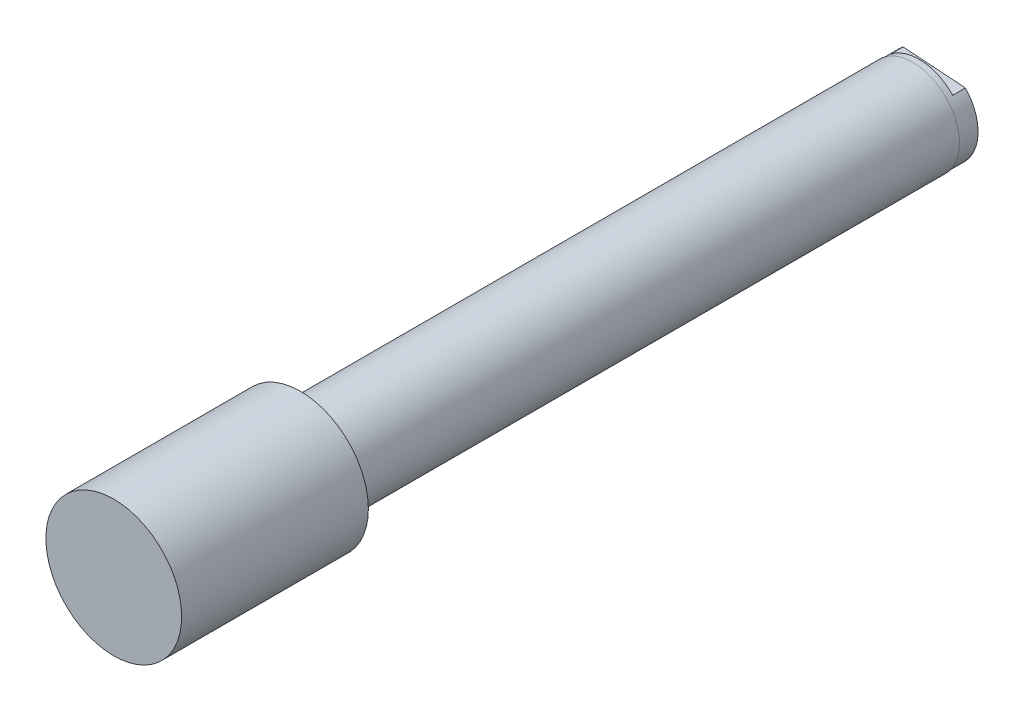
ISO-10303-21;
HEADER;
FILE_DESCRIPTION(('STEP AP214'),'2;1');
FILE_NAME('part.step','',(''),(''),'','','');
FILE_SCHEMA(('AUTOMOTIVE_DESIGN { 1 0 10303 214 1 1 1 1 }'));
ENDSEC;
DATA;
#1=APPLICATION_CONTEXT('core data for automotive mechanical design processes');
#2=APPLICATION_PROTOCOL_DEFINITION('international standard','automotive_design',2000,#1);
#3=PRODUCT_CONTEXT('',#1,'mechanical');
#4=PRODUCT('Part','Part','',(#3));
#5=PRODUCT_RELATED_PRODUCT_CATEGORY('part','',(#4));
#6=PRODUCT_DEFINITION_FORMATION('','',#4);
#7=PRODUCT_DEFINITION_CONTEXT('part definition',#1,'design');
#8=PRODUCT_DEFINITION('design','',#6,#7);
#9=PRODUCT_DEFINITION_SHAPE('','',#8);
#10=(LENGTH_UNIT() NAMED_UNIT(*) SI_UNIT(.MILLI.,.METRE.));
#11=(NAMED_UNIT(*) PLANE_ANGLE_UNIT() SI_UNIT($,.RADIAN.));
#12=(NAMED_UNIT(*) SI_UNIT($,.STERADIAN.) SOLID_ANGLE_UNIT());
#13=UNCERTAINTY_MEASURE_WITH_UNIT(LENGTH_MEASURE(1.E-05),#10,'distance_accuracy_value','');
#14=(GEOMETRIC_REPRESENTATION_CONTEXT(3) GLOBAL_UNCERTAINTY_ASSIGNED_CONTEXT((#13)) GLOBAL_UNIT_ASSIGNED_CONTEXT((#10,
#11,#12)) REPRESENTATION_CONTEXT('',''));
#15=CARTESIAN_POINT('',(0.,0.,0.));
#16=DIRECTION('',(0.,0.,1.));
#17=DIRECTION('',(1.,0.,0.));
#18=AXIS2_PLACEMENT_3D('',#15,#16,#17);
#19=CARTESIAN_POINT('',(0.,0.,-99.06));
#20=DIRECTION('',(0.,0.,1.));
#21=DIRECTION('',(0.997564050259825,-0.0697564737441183,0.));
#22=AXIS2_PLACEMENT_3D('',#19,#20,#21);
#23=PLANE('',#22);
#24=CARTESIAN_POINT('',(0.,0.,-99.06));
#25=DIRECTION('',(0.,0.,1.));
#26=DIRECTION('',(0.997564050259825,-0.0697564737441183,0.));
#27=AXIS2_PLACEMENT_3D('',#24,#25,#26);
#28=CIRCLE('',#27,3.4544);
#29=CARTESIAN_POINT('',(3.44598525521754,-0.240966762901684,-99.06));
#30=VERTEX_POINT('',#29);
#31=EDGE_CURVE('E11',#30,#30,#28,.F.);
#32=ORIENTED_EDGE('',*,*,#31,.T.);
#33=EDGE_LOOP('',(#32));
#34=FACE_BOUND('',#33,.T.);
#35=ADVANCED_FACE('F18',(#34),#23,.F.);
#36=CARTESIAN_POINT('',(0.,0.,-118.11));
#37=DIRECTION('',(0.,0.,-1.));
#38=DIRECTION('',(-0.997564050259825,0.0697564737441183,0.));
#39=AXIS2_PLACEMENT_3D('',#36,#37,#38);
#40=CYLINDRICAL_SURFACE('',#39,3.4544);
#41=CARTESIAN_POINT('',(0.,0.,-118.11));
#42=DIRECTION('',(0.,0.,-1.));
#43=DIRECTION('',(-0.997564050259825,0.0697564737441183,0.));
#44=AXIS2_PLACEMENT_3D('',#41,#42,#43);
#45=CIRCLE('',#44,3.4544);
#46=CARTESIAN_POINT('',(-3.44598525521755,0.24096676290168,-118.11));
#47=VERTEX_POINT('',#46);
#48=EDGE_CURVE('E90',#47,#47,#45,.T.);
#49=ORIENTED_EDGE('',*,*,#48,.T.);
#50=EDGE_LOOP('',(#49));
#51=FACE_BOUND('',#50,.T.);
#52=ORIENTED_EDGE('',*,*,#31,.F.);
#53=EDGE_LOOP('',(#52));
#54=FACE_BOUND('',#53,.T.);
#55=ADVANCED_FACE('F130',(#51,#54),#40,.F.);
#56=CARTESIAN_POINT('',(0.,0.,-118.11));
#57=DIRECTION('',(0.,0.,1.));
#58=DIRECTION('',(0.997564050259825,-0.0697564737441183,0.));
#59=AXIS2_PLACEMENT_3D('',#56,#57,#58);
#60=PLANE('',#59);
#61=ORIENTED_EDGE('',*,*,#48,.F.);
#62=EDGE_LOOP('',(#61));
#63=FACE_BOUND('',#62,.T.);
#64=CARTESIAN_POINT('',(0.,0.,-118.11));
#65=DIRECTION('',(0.,0.,-1.));
#66=DIRECTION('',(-0.997564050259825,0.0697564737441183,0.));
#67=AXIS2_PLACEMENT_3D('',#64,#65,#66);
#68=CIRCLE('',#67,8.636);
#69=CARTESIAN_POINT('',(-6.28172897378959,-5.9262447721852,-118.11));
#70=VERTEX_POINT('',#69);
#71=CARTESIAN_POINT('',(-5.39582175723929,6.74281866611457,-118.11));
#72=VERTEX_POINT('',#71);
#73=EDGE_CURVE('E27',#70,#72,#68,.T.);
#74=ORIENTED_EDGE('',*,*,#73,.T.);
#75=DIRECTION('',(-0.997564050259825,0.0697564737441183,0.));
#76=VECTOR('',#75,1.);
#77=CARTESIAN_POINT('',(6.28172897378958,5.9262447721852,-118.11));
#78=LINE('',#77,#76);
#79=CARTESIAN_POINT('',(6.28172897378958,5.9262447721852,-118.11));
#80=VERTEX_POINT('',#79);
#81=EDGE_CURVE('E64',#80,#72,#78,.T.);
#82=ORIENTED_EDGE('',*,*,#81,.F.);
#83=CARTESIAN_POINT('',(5.39582175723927,-6.74281866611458,-118.11));
#84=VERTEX_POINT('',#83);
#85=EDGE_CURVE('E76',#80,#84,#68,.T.);
#86=ORIENTED_EDGE('',*,*,#85,.T.);
#87=DIRECTION('',(0.997564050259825,-0.0697564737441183,0.));
#88=VECTOR('',#87,1.);
#89=CARTESIAN_POINT('',(5.39582175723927,-6.74281866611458,-118.11));
#90=LINE('',#89,#88);
#91=EDGE_CURVE('E78',#70,#84,#90,.T.);
#92=ORIENTED_EDGE('',*,*,#91,.F.);
#93=EDGE_LOOP('',(#74,#82,#86,#92));
#94=FACE_BOUND('',#93,.T.);
#95=ADVANCED_FACE('F115',(#63,#94),#60,.F.);
#96=CARTESIAN_POINT('',(0.,0.,-119.104542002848));
#97=DIRECTION('',(0.,0.,-1.));
#98=DIRECTION('',(-0.997564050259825,0.0697564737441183,0.));
#99=AXIS2_PLACEMENT_3D('',#96,#97,#98);
#100=CYLINDRICAL_SURFACE('',#99,8.636);
#101=CARTESIAN_POINT('',(0.,0.,-115.7224));
#102=DIRECTION('',(0.,0.,-1.));
#103=DIRECTION('',(-0.997564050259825,0.0697564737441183,0.));
#104=AXIS2_PLACEMENT_3D('',#101,#102,#103);
#105=CIRCLE('',#104,8.636);
#106=CARTESIAN_POINT('',(-5.39582175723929,6.74281866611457,-115.7224));
#107=VERTEX_POINT('',#106);
#108=CARTESIAN_POINT('',(6.28172897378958,5.9262447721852,-115.7224));
#109=VERTEX_POINT('',#108);
#110=EDGE_CURVE('E59',#107,#109,#105,.T.);
#111=ORIENTED_EDGE('',*,*,#110,.F.);
#112=DIRECTION('',(0.,0.,-1.));
#113=VECTOR('',#112,1.);
#114=CARTESIAN_POINT('',(-5.39582175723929,6.74281866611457,-115.7224));
#115=LINE('',#114,#113);
#116=EDGE_CURVE('E70',#107,#72,#115,.T.);
#117=ORIENTED_EDGE('',*,*,#116,.T.);
#118=ORIENTED_EDGE('',*,*,#73,.F.);
#119=DIRECTION('',(0.,0.,-1.));
#120=VECTOR('',#119,1.);
#121=CARTESIAN_POINT('',(-6.28172897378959,-5.9262447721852,-115.7224));
#122=LINE('',#121,#120);
#123=CARTESIAN_POINT('',(-6.28172897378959,-5.9262447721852,-115.7224));
#124=VERTEX_POINT('',#123);
#125=EDGE_CURVE('E85',#124,#70,#122,.T.);
#126=ORIENTED_EDGE('',*,*,#125,.F.);
#127=CARTESIAN_POINT('',(0.,0.,-115.7224));
#128=DIRECTION('',(0.,0.,-1.));
#129=DIRECTION('',(-0.997564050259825,0.0697564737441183,0.));
#130=AXIS2_PLACEMENT_3D('',#127,#128,#129);
#131=CIRCLE('',#130,8.636);
#132=CARTESIAN_POINT('',(5.39582175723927,-6.74281866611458,-115.7224));
#133=VERTEX_POINT('',#132);
#134=EDGE_CURVE('E82',#133,#124,#131,.T.);
#135=ORIENTED_EDGE('',*,*,#134,.F.);
#136=DIRECTION('',(0.,0.,-1.));
#137=VECTOR('',#136,1.);
#138=CARTESIAN_POINT('',(5.39582175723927,-6.74281866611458,-115.7224));
#139=LINE('',#138,#137);
#140=EDGE_CURVE('E88',#133,#84,#139,.T.);
#141=ORIENTED_EDGE('',*,*,#140,.T.);
#142=ORIENTED_EDGE('',*,*,#85,.F.);
#143=DIRECTION('',(0.,0.,-1.));
#144=VECTOR('',#143,1.);
#145=CARTESIAN_POINT('',(6.28172897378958,5.9262447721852,-115.7224));
#146=LINE('',#145,#144);
#147=EDGE_CURVE('E68',#109,#80,#146,.T.);
#148=ORIENTED_EDGE('',*,*,#147,.F.);
#149=EDGE_LOOP('',(#111,#117,#118,#126,#135,#141,#142,#148));
#150=FACE_BOUND('',#149,.T.);
#151=CARTESIAN_POINT('',(0.,0.,-114.5286));
#152=DIRECTION('',(0.,0.,-1.));
#153=DIRECTION('',(-0.997564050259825,0.0697564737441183,0.));
#154=AXIS2_PLACEMENT_3D('',#151,#152,#153);
#155=CIRCLE('',#154,8.636);
#156=CARTESIAN_POINT('',(-8.61496313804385,0.602416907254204,-114.5286));
#157=VERTEX_POINT('',#156);
#158=EDGE_CURVE('E94',#157,#157,#155,.T.);
#159=ORIENTED_EDGE('',*,*,#158,.T.);
#160=EDGE_LOOP('',(#159));
#161=FACE_BOUND('',#160,.T.);
#162=ADVANCED_FACE('F73',(#150,#161),#100,.T.);
#163=CARTESIAN_POINT('',(5.39582175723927,-6.74281866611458,-115.7224));
#164=DIRECTION('',(0.0697564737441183,0.997564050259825,0.));
#165=DIRECTION('',(-0.997564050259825,0.0697564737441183,0.));
#166=AXIS2_PLACEMENT_3D('',#163,#164,#165);
#167=PLANE('',#166);
#168=ORIENTED_EDGE('',*,*,#91,.T.);
#169=ORIENTED_EDGE('',*,*,#140,.F.);
#170=DIRECTION('',(0.997564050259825,-0.0697564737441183,0.));
#171=VECTOR('',#170,1.);
#172=CARTESIAN_POINT('',(5.39582175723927,-6.74281866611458,-115.7224));
#173=LINE('',#172,#171);
#174=EDGE_CURVE('E41',#124,#133,#173,.T.);
#175=ORIENTED_EDGE('',*,*,#174,.F.);
#176=ORIENTED_EDGE('',*,*,#125,.T.);
#177=EDGE_LOOP('',(#168,#169,#175,#176));
#178=FACE_BOUND('',#177,.T.);
#179=ADVANCED_FACE('F117',(#178),#167,.F.);
#180=CARTESIAN_POINT('',(0.,0.,-115.7224));
#181=DIRECTION('',(0.,0.,-1.));
#182=DIRECTION('',(-0.997564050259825,0.0697564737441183,0.));
#183=AXIS2_PLACEMENT_3D('',#180,#181,#182);
#184=PLANE('',#183);
#185=ORIENTED_EDGE('',*,*,#134,.T.);
#186=ORIENTED_EDGE('',*,*,#174,.T.);
#187=EDGE_LOOP('',(#185,#186));
#188=FACE_BOUND('',#187,.T.);
#189=ADVANCED_FACE('F119',(#188),#184,.T.);
#190=CARTESIAN_POINT('',(6.28172897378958,5.9262447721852,-115.7224));
#191=DIRECTION('',(-0.0697564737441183,-0.997564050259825,0.));
#192=DIRECTION('',(0.997564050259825,-0.0697564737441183,0.));
#193=AXIS2_PLACEMENT_3D('',#190,#191,#192);
#194=PLANE('',#193);
#195=ORIENTED_EDGE('',*,*,#81,.T.);
#196=ORIENTED_EDGE('',*,*,#116,.F.);
#197=DIRECTION('',(-0.997564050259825,0.0697564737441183,0.));
#198=VECTOR('',#197,1.);
#199=CARTESIAN_POINT('',(6.28172897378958,5.9262447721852,-115.7224));
#200=LINE('',#199,#198);
#201=EDGE_CURVE('E34',#109,#107,#200,.T.);
#202=ORIENTED_EDGE('',*,*,#201,.F.);
#203=ORIENTED_EDGE('',*,*,#147,.T.);
#204=EDGE_LOOP('',(#195,#196,#202,#203));
#205=FACE_BOUND('',#204,.T.);
#206=ADVANCED_FACE('F67',(#205),#194,.F.);
#207=CARTESIAN_POINT('',(0.,0.,-115.7224));
#208=DIRECTION('',(0.,0.,-1.));
#209=DIRECTION('',(-0.997564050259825,0.0697564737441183,0.));
#210=AXIS2_PLACEMENT_3D('',#207,#208,#209);
#211=PLANE('',#210);
#212=ORIENTED_EDGE('',*,*,#110,.T.);
#213=ORIENTED_EDGE('',*,*,#201,.T.);
#214=EDGE_LOOP('',(#212,#213));
#215=FACE_BOUND('',#214,.T.);
#216=ADVANCED_FACE('F60',(#215),#211,.T.);
#217=CARTESIAN_POINT('',(0.,0.,34.925));
#218=DIRECTION('',(0.,0.,1.));
#219=DIRECTION('',(1.,0.,0.));
#220=AXIS2_PLACEMENT_3D('',#217,#218,#219);
#221=PLANE('',#220);
#222=CARTESIAN_POINT('',(0.,0.,34.925));
#223=DIRECTION('',(0.,0.,1.));
#224=DIRECTION('',(1.,0.,0.));
#225=AXIS2_PLACEMENT_3D('',#222,#223,#224);
#226=CIRCLE('',#225,12.7);
#227=CARTESIAN_POINT('',(12.7,0.,34.925));
#228=VERTEX_POINT('',#227);
#229=EDGE_CURVE('E99',#228,#228,#226,.T.);
#230=ORIENTED_EDGE('',*,*,#229,.T.);
#231=EDGE_LOOP('',(#230));
#232=FACE_BOUND('',#231,.T.);
#233=ADVANCED_FACE('F148',(#232),#221,.T.);
#234=CARTESIAN_POINT('',(0.,0.,34.925));
#235=DIRECTION('',(0.,0.,-1.));
#236=DIRECTION('',(-1.,0.,0.));
#237=AXIS2_PLACEMENT_3D('',#234,#235,#236);
#238=CYLINDRICAL_SURFACE('',#237,12.7);
#239=ORIENTED_EDGE('',*,*,#229,.F.);
#240=EDGE_LOOP('',(#239));
#241=FACE_BOUND('',#240,.T.);
#242=CARTESIAN_POINT('',(0.,0.,0.));
#243=DIRECTION('',(0.,0.,1.));
#244=DIRECTION('',(1.,0.,0.));
#245=AXIS2_PLACEMENT_3D('',#242,#243,#244);
#246=CIRCLE('',#245,12.7);
#247=CARTESIAN_POINT('',(12.7,0.,0.));
#248=VERTEX_POINT('',#247);
#249=EDGE_CURVE('E103',#248,#248,#246,.T.);
#250=ORIENTED_EDGE('',*,*,#249,.T.);
#251=EDGE_LOOP('',(#250));
#252=FACE_BOUND('',#251,.T.);
#253=ADVANCED_FACE('F151',(#241,#252),#238,.T.);
#254=CARTESIAN_POINT('',(0.,0.,0.));
#255=DIRECTION('',(0.,0.,1.));
#256=DIRECTION('',(1.,0.,0.));
#257=AXIS2_PLACEMENT_3D('',#254,#255,#256);
#258=PLANE('',#257);
#259=CARTESIAN_POINT('',(0.,0.,0.));
#260=DIRECTION('',(0.,0.,1.));
#261=DIRECTION('',(1.,0.,0.));
#262=AXIS2_PLACEMENT_3D('',#259,#260,#261);
#263=CIRCLE('',#262,8.7376);
#264=CARTESIAN_POINT('',(8.7376,0.,0.));
#265=VERTEX_POINT('',#264);
#266=EDGE_CURVE('E102',#265,#265,#263,.F.);
#267=ORIENTED_EDGE('',*,*,#266,.F.);
#268=EDGE_LOOP('',(#267));
#269=FACE_BOUND('',#268,.T.);
#270=ORIENTED_EDGE('',*,*,#249,.F.);
#271=EDGE_LOOP('',(#270));
#272=FACE_BOUND('',#271,.T.);
#273=ADVANCED_FACE('F143',(#269,#272),#258,.F.);
#274=CARTESIAN_POINT('',(0.,0.,0.));
#275=DIRECTION('',(0.,0.,-1.));
#276=DIRECTION('',(-1.,0.,0.));
#277=AXIS2_PLACEMENT_3D('',#274,#275,#276);
#278=CYLINDRICAL_SURFACE('',#277,8.7376);
#279=CARTESIAN_POINT('',(0.,0.,-114.5286));
#280=DIRECTION('',(0.,0.,-1.));
#281=DIRECTION('',(-1.,0.,0.));
#282=AXIS2_PLACEMENT_3D('',#279,#280,#281);
#283=CIRCLE('',#282,8.7376);
#284=CARTESIAN_POINT('',(-8.7376,0.,-114.5286));
#285=VERTEX_POINT('',#284);
#286=EDGE_CURVE('E22',#285,#285,#283,.T.);
#287=ORIENTED_EDGE('',*,*,#286,.F.);
#288=EDGE_LOOP('',(#287));
#289=FACE_BOUND('',#288,.T.);
#290=ORIENTED_EDGE('',*,*,#266,.T.);
#291=EDGE_LOOP('',(#290));
#292=FACE_BOUND('',#291,.T.);
#293=ADVANCED_FACE('F20',(#289,#292),#278,.T.);
#294=CARTESIAN_POINT('',(0.,0.,-114.5286));
#295=DIRECTION('',(0.,0.,-1.));
#296=DIRECTION('',(-1.,0.,0.));
#297=AXIS2_PLACEMENT_3D('',#294,#295,#296);
#298=PLANE('',#297);
#299=ORIENTED_EDGE('',*,*,#158,.F.);
#300=EDGE_LOOP('',(#299));
#301=FACE_BOUND('',#300,.T.);
#302=ORIENTED_EDGE('',*,*,#286,.T.);
#303=EDGE_LOOP('',(#302));
#304=FACE_BOUND('',#303,.T.);
#305=ADVANCED_FACE('F158',(#301,#304),#298,.T.);
#306=CLOSED_SHELL('',(#35,#55,#95,#162,#179,#189,#206,#216,#233,#253,#273,#293,#305));
#307=MANIFOLD_SOLID_BREP('B1',#306);
#308=ADVANCED_BREP_SHAPE_REPRESENTATION('',(#18,#307),#14);
#309=SHAPE_DEFINITION_REPRESENTATION(#9,#308);
ENDSEC;
END-ISO-10303-21;
